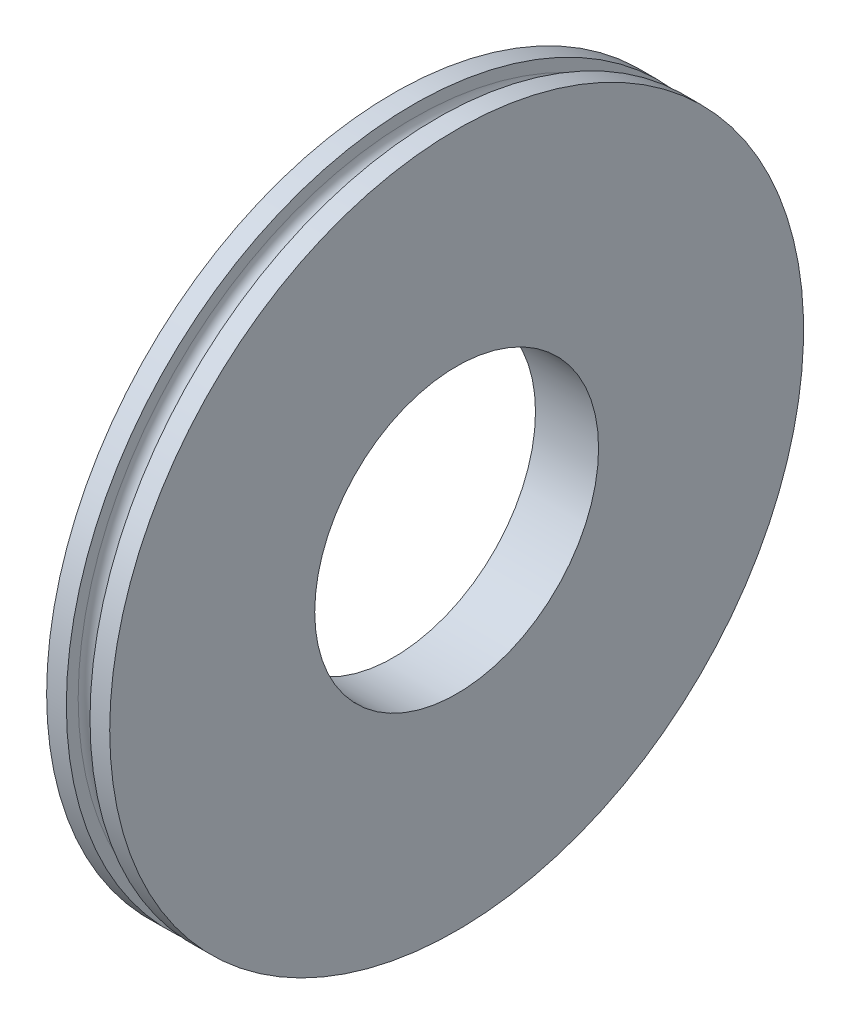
from build123d import *

# Parameters (mm, degrees)
SKETCH2_R          = 14.2875
CUT_EXTRUDE1_DEPTH = 50.797929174


with BuildPart() as part:
    # Sketch1 → Revolve1 (revolve)
    with BuildSketch(Plane.XY, mode=Mode.PRIVATE) as revolve1_sk:
        with BuildLine():
            Line((-3.175, 0), (3.175, 0))
            Line((3.175, 0), (3.175, 33.734375))
            Line((3.175, 33.734375), (3.175, 34.925))
            Line((3.175, 34.925), (1.190625, 34.925))
            Line((1.190625, 34.925), (1.190625, 33.734375))
            ThreePointArc((1.190625, 33.734375), (0, 32.54375), (-1.190625, 33.734375))
            Line((-1.190625, 33.734375), (-1.190625, 34.925))
            Line((-1.190625, 34.925), (-3.175, 34.925))
            Line((-3.175, 34.925), (-3.175, 33.734375))
            Line((-3.175, 33.734375), (-3.175, 0))
        make_face()
    revolve(revolve1_sk.sketch.rotate(Axis((-3.175, 0, 0), (1, 0, 0)), 90), axis=Axis((-3.175, 0, 0), (1, 0, 0)))

    # Sketch2 → Cut-Extrude1 (cut, through all)
    with BuildSketch(Plane(origin=(3.175, 0, 0), x_dir=(0, 0, -1), z_dir=(1, 0, 0))):
        Circle(SKETCH2_R)
    extrude(amount=-CUT_EXTRUDE1_DEPTH, mode=Mode.SUBTRACT)


solid = part.part
